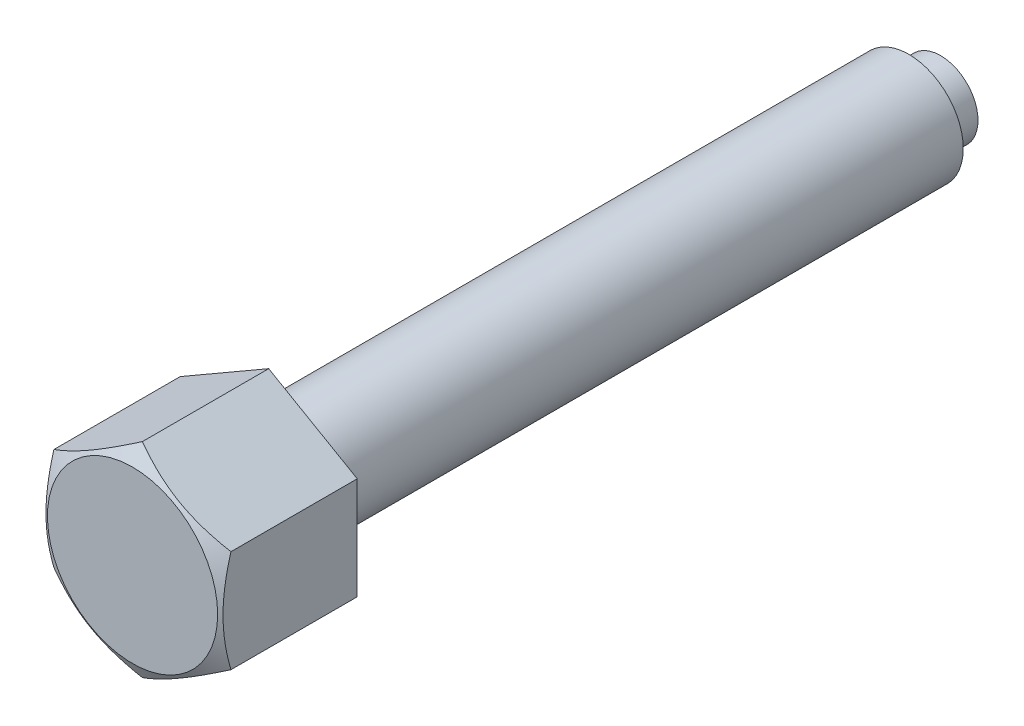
ISO-10303-21;
HEADER;
FILE_DESCRIPTION(('STEP AP214'),'2;1');
FILE_NAME('part.step','',(''),(''),'','','');
FILE_SCHEMA(('AUTOMOTIVE_DESIGN { 1 0 10303 214 1 1 1 1 }'));
ENDSEC;
DATA;
#1=APPLICATION_CONTEXT('core data for automotive mechanical design processes');
#2=APPLICATION_PROTOCOL_DEFINITION('international standard','automotive_design',2000,#1);
#3=PRODUCT_CONTEXT('',#1,'mechanical');
#4=PRODUCT('Part','Part','',(#3));
#5=PRODUCT_RELATED_PRODUCT_CATEGORY('part','',(#4));
#6=PRODUCT_DEFINITION_FORMATION('','',#4);
#7=PRODUCT_DEFINITION_CONTEXT('part definition',#1,'design');
#8=PRODUCT_DEFINITION('design','',#6,#7);
#9=PRODUCT_DEFINITION_SHAPE('','',#8);
#10=(LENGTH_UNIT() NAMED_UNIT(*) SI_UNIT(.MILLI.,.METRE.));
#11=(NAMED_UNIT(*) PLANE_ANGLE_UNIT() SI_UNIT($,.RADIAN.));
#12=(NAMED_UNIT(*) SI_UNIT($,.STERADIAN.) SOLID_ANGLE_UNIT());
#13=UNCERTAINTY_MEASURE_WITH_UNIT(LENGTH_MEASURE(1.E-05),#10,'distance_accuracy_value','');
#14=(GEOMETRIC_REPRESENTATION_CONTEXT(3) GLOBAL_UNCERTAINTY_ASSIGNED_CONTEXT((#13)) GLOBAL_UNIT_ASSIGNED_CONTEXT((#10,
#11,#12)) REPRESENTATION_CONTEXT('',''));
#15=CARTESIAN_POINT('',(0.,0.,0.));
#16=DIRECTION('',(0.,0.,1.));
#17=DIRECTION('',(1.,0.,0.));
#18=AXIS2_PLACEMENT_3D('',#15,#16,#17);
#19=CARTESIAN_POINT('',(0.,7.50555349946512,48.));
#20=DIRECTION('',(-0.5,-0.86602540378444,0.));
#21=DIRECTION('',(0.86602540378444,-0.5,0.));
#22=AXIS2_PLACEMENT_3D('',#19,#20,#21);
#23=PLANE('',#22);
#24=CARTESIAN_POINT('',(6.5002,3.75266127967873,59.2750391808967));
#25=CARTESIAN_POINT('',(6.35732254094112,3.8351516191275,59.3226580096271));
#26=CARTESIAN_POINT('',(6.21391236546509,3.91794952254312,59.3681157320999));
#27=CARTESIAN_POINT('',(5.92592736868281,4.08421773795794,59.4541137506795));
#28=CARTESIAN_POINT('',(5.78135207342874,4.16768832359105,59.4946519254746));
#29=CARTESIAN_POINT('',(5.34531134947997,4.41943655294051,59.6080914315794));
#30=CARTESIAN_POINT('',(5.05212471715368,4.58870793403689,59.6726146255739));
#31=CARTESIAN_POINT('',(4.61337625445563,4.84201947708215,59.7482758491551));
#32=CARTESIAN_POINT('',(4.46912536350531,4.92530276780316,59.7698295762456));
#33=CARTESIAN_POINT('',(4.17997178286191,5.09224566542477,59.8059721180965));
#34=CARTESIAN_POINT('',(4.03506915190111,5.17590523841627,59.8205615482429));
#35=CARTESIAN_POINT('',(3.74501222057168,5.34336968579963,59.8424036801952));
#36=CARTESIAN_POINT('',(3.59985839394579,5.42717428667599,59.8496647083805));
#37=CARTESIAN_POINT('',(3.30942466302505,5.59485627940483,59.8567021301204));
#38=CARTESIAN_POINT('',(3.16414476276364,5.6787336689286,59.8564787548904));
#39=CARTESIAN_POINT('',(2.76612405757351,5.90853103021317,59.8455789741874));
#40=CARTESIAN_POINT('',(2.51351353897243,6.05437578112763,59.8272806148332));
#41=CARTESIAN_POINT('',(2.00997032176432,6.34509659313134,59.7692560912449));
#42=CARTESIAN_POINT('',(1.75903939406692,6.48997163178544,59.7295100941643));
#43=CARTESIAN_POINT('',(1.25448277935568,6.78127752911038,59.6301565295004));
#44=CARTESIAN_POINT('',(1.00092075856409,6.92767163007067,59.5701280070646));
#45=CARTESIAN_POINT('',(0.497578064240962,7.21827667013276,59.4338874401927));
#46=CARTESIAN_POINT('',(0.247790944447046,7.36249133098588,59.357707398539));
#47=CARTESIAN_POINT('',(-0.000199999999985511,7.50566896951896,59.2750391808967));
#48=B_SPLINE_CURVE_WITH_KNOTS('',3,(#24,#25,#26,#27,#28,#29,#30,#31,#32,#33,#34,#35,#36,#37,#38,
#39,#40,#41,#42,#43,#44,#45,#46,#47),.UNSPECIFIED.,.F.,.F.,(4,2,2,2,2,2,2,2,2,2,2,4),(0.,
0.51510505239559,1.03043143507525,2.06322554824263,2.56697389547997,3.07067772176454,
3.57380860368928,4.07692394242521,4.9527935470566,5.82947446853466,6.72559912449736,
7.61996451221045),.UNSPECIFIED.);
#49=CARTESIAN_POINT('',(6.5,3.75277674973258,59.2751058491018));
#50=VERTEX_POINT('',#49);
#51=CARTESIAN_POINT('',(0.,7.50555349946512,59.2751058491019));
#52=VERTEX_POINT('',#51);
#53=EDGE_CURVE('E30',#50,#52,#48,.T.);
#54=ORIENTED_EDGE('',*,*,#53,.F.);
#55=DIRECTION('',(0.,0.,1.));
#56=VECTOR('',#55,1.);
#57=CARTESIAN_POINT('',(6.5,3.75277674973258,48.));
#58=LINE('',#57,#56);
#59=CARTESIAN_POINT('',(6.5,3.75277674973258,50.));
#60=VERTEX_POINT('',#59);
#61=EDGE_CURVE('E97',#60,#50,#58,.T.);
#62=ORIENTED_EDGE('',*,*,#61,.F.);
#63=DIRECTION('',(0.86602540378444,-0.5,0.));
#64=VECTOR('',#63,1.);
#65=CARTESIAN_POINT('',(6.25,3.89711431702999,50.));
#66=LINE('',#65,#64);
#67=CARTESIAN_POINT('',(0.,7.50555349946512,50.));
#68=VERTEX_POINT('',#67);
#69=EDGE_CURVE('E111',#68,#60,#66,.T.);
#70=ORIENTED_EDGE('',*,*,#69,.F.);
#71=DIRECTION('',(0.,0.,1.));
#72=VECTOR('',#71,1.);
#73=CARTESIAN_POINT('',(0.,7.50555349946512,48.));
#74=LINE('',#73,#72);
#75=EDGE_CURVE('E37',#68,#52,#74,.T.);
#76=ORIENTED_EDGE('',*,*,#75,.T.);
#77=EDGE_LOOP('',(#54,#62,#70,#76));
#78=FACE_BOUND('',#77,.T.);
#79=ADVANCED_FACE('F15',(#78),#23,.F.);
#80=CARTESIAN_POINT('',(6.5,3.75277674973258,48.));
#81=DIRECTION('',(-1.,0.,0.));
#82=DIRECTION('',(0.,-1.,0.));
#83=AXIS2_PLACEMENT_3D('',#80,#81,#82);
#84=PLANE('',#83);
#85=CARTESIAN_POINT('',(6.5,-10.0139298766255,56.715718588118));
#86=CARTESIAN_POINT('',(6.5,-9.73058065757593,56.8528996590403));
#87=CARTESIAN_POINT('',(6.5,-9.44657378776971,56.9887459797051));
#88=CARTESIAN_POINT('',(6.5,-8.87689475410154,57.2570170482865));
#89=CARTESIAN_POINT('',(6.5,-8.59122233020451,57.3894412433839));
#90=CARTESIAN_POINT('',(6.5,-8.01635817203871,57.6507965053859));
#91=CARTESIAN_POINT('',(6.5,-7.72715570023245,57.7797040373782));
#92=CARTESIAN_POINT('',(6.5,-7.14642707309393,58.032154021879));
#93=CARTESIAN_POINT('',(6.5,-6.85490103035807,58.1556967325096));
#94=CARTESIAN_POINT('',(6.5,-6.25991674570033,58.3997495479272));
#95=CARTESIAN_POINT('',(6.5,-5.95636992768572,58.5200449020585));
#96=CARTESIAN_POINT('',(6.5,-5.34570022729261,58.7513690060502));
#97=CARTESIAN_POINT('',(6.5,-5.03857694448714,58.8623967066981));
#98=CARTESIAN_POINT('',(6.5,-4.42086358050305,59.0722223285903));
#99=CARTESIAN_POINT('',(6.5,-4.11028219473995,59.1710455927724));
#100=CARTESIAN_POINT('',(6.5,-3.48466200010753,59.3532463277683));
#101=CARTESIAN_POINT('',(6.5,-3.16962465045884,59.436628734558));
#102=CARTESIAN_POINT('',(6.5,-2.53666221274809,59.5834676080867));
#103=CARTESIAN_POINT('',(6.5,-2.21876196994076,59.6470294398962));
#104=CARTESIAN_POINT('',(6.5,-1.57903427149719,59.7505723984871));
#105=CARTESIAN_POINT('',(6.5,-1.25720716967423,59.7905556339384));
#106=CARTESIAN_POINT('',(6.5,-0.774936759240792,59.8301899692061));
#107=CARTESIAN_POINT('',(6.5,-0.61528846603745,59.8400119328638));
#108=CARTESIAN_POINT('',(6.5,-0.29571263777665,59.85290641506));
#109=CARTESIAN_POINT('',(6.5,-0.135785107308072,59.855979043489));
#110=CARTESIAN_POINT('',(6.5,0.18405523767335,59.8552940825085));
#111=CARTESIAN_POINT('',(6.5,0.343968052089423,59.8515364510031));
#112=CARTESIAN_POINT('',(6.5,0.663495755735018,59.8372836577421));
#113=CARTESIAN_POINT('',(6.5,0.823110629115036,59.8267881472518));
#114=CARTESIAN_POINT('',(6.5,1.20875169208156,59.7935096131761));
#115=CARTESIAN_POINT('',(6.5,1.43449799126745,59.7674163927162));
#116=CARTESIAN_POINT('',(6.5,1.88426052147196,59.7031906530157));
#117=CARTESIAN_POINT('',(6.5,2.10827650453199,59.6650564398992));
#118=CARTESIAN_POINT('',(6.5,2.77750341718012,59.5346190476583));
#119=CARTESIAN_POINT('',(6.5,3.21963223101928,59.4263065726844));
#120=CARTESIAN_POINT('',(6.5,3.88064905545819,59.239172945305));
#121=CARTESIAN_POINT('',(6.5,4.10298279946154,59.1718291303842));
#122=CARTESIAN_POINT('',(6.5,4.54548971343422,59.0303191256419));
#123=CARTESIAN_POINT('',(6.5,4.76566286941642,58.9561528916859));
#124=CARTESIAN_POINT('',(6.5,5.20392125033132,58.8021736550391));
#125=CARTESIAN_POINT('',(6.5,5.4220071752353,58.7223626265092));
#126=CARTESIAN_POINT('',(6.5,5.85638376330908,58.5580156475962));
#127=CARTESIAN_POINT('',(6.5,6.07267444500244,58.4734797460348));
#128=CARTESIAN_POINT('',(6.5,6.57261566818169,58.2727908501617));
#129=CARTESIAN_POINT('',(6.5,6.8556779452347,58.1551753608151));
#130=CARTESIAN_POINT('',(6.5,7.4194854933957,57.9145016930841));
#131=CARTESIAN_POINT('',(6.5,7.70023063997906,57.7914432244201));
#132=CARTESIAN_POINT('',(6.5,8.25981709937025,57.540947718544));
#133=CARTESIAN_POINT('',(6.5,8.53865805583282,57.4135098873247));
#134=CARTESIAN_POINT('',(6.5,9.09470419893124,57.1551081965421));
#135=CARTESIAN_POINT('',(6.5,9.37190935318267,57.0241442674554));
#136=CARTESIAN_POINT('',(6.5,9.92519356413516,56.759216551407));
#137=CARTESIAN_POINT('',(6.5,10.2012713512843,56.6252501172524));
#138=CARTESIAN_POINT('',(6.5,10.7522585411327,56.3549336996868));
#139=CARTESIAN_POINT('',(6.5,11.027167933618,56.2185836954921));
#140=CARTESIAN_POINT('',(6.5,11.8504287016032,55.8065716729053));
#141=CARTESIAN_POINT('',(6.5,12.3973011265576,55.5279532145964));
#142=CARTESIAN_POINT('',(6.5,13.1934294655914,55.1171865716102));
#143=CARTESIAN_POINT('',(6.5,13.4438297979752,54.9872425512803));
#144=CARTESIAN_POINT('',(6.5,13.9440869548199,54.7263219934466));
#145=CARTESIAN_POINT('',(6.5,14.19394378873,54.5953454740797));
#146=CARTESIAN_POINT('',(6.5,14.9428276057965,54.201065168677));
#147=CARTESIAN_POINT('',(6.5,15.4411486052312,53.9364206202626));
#148=CARTESIAN_POINT('',(6.5,16.4351698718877,53.4050149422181));
#149=CARTESIAN_POINT('',(6.5,16.9308735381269,53.1382601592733));
#150=CARTESIAN_POINT('',(6.5,17.9210819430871,52.602594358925));
#151=CARTESIAN_POINT('',(6.5,18.4155867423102,52.3336834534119));
#152=CARTESIAN_POINT('',(6.5,18.9096470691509,52.0639635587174));
#153=B_SPLINE_CURVE_WITH_KNOTS('',3,(#85,#86,#87,#88,#89,#90,#91,#92,#93,#94,#95,#96,#97,#98,
#99,#100,#101,#102,#103,#104,#105,#106,#107,#108,#109,#110,#111,#112,#113,#114,#115,#116,#117,
#118,#119,#120,#121,#122,#123,#124,#125,#126,#127,#128,#129,#130,#131,#132,#133,#134,#135,#136,
#137,#138,#139,#140,#141,#142,#143,#144,#145,#146,#147,#148,#149,#150,#151,#152),.UNSPECIFIED.,
.F.,.F.,(4,2,2,2,2,2,2,2,2,2,2,2,2,2,2,2,2,2,2,2,2,2,2,2,2,2,2,2,2,2,2,2,2,4),(0.,
0.944442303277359,1.88903623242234,2.83888579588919,3.78868960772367,4.7681159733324,
5.74765307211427,6.72512064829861,7.70227521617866,8.67414306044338,9.64592397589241,
10.1256534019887,10.6053750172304,11.0850995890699,11.5648489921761,12.2462106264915,
12.927668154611,14.291366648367,14.9882378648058,15.6851135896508,16.3817467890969,
17.0783727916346,17.9978725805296,18.9174214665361,19.8371379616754,20.7568726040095,
21.6774527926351,22.5980410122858,24.4392558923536,25.2855836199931,26.1318965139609,
27.8245874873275,29.5133454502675,31.2020163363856),.UNSPECIFIED.);
#154=CARTESIAN_POINT('',(6.5,-3.75277674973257,59.2751058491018));
#155=VERTEX_POINT('',#154);
#156=EDGE_CURVE('E157',#155,#50,#153,.T.);
#157=ORIENTED_EDGE('',*,*,#156,.F.);
#158=DIRECTION('',(0.,0.,1.));
#159=VECTOR('',#158,1.);
#160=CARTESIAN_POINT('',(6.5,-3.75277674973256,48.));
#161=LINE('',#160,#159);
#162=CARTESIAN_POINT('',(6.5,-3.75277674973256,50.));
#163=VERTEX_POINT('',#162);
#164=EDGE_CURVE('E94',#163,#155,#161,.T.);
#165=ORIENTED_EDGE('',*,*,#164,.F.);
#166=DIRECTION('',(0.,-1.,0.));
#167=VECTOR('',#166,1.);
#168=CARTESIAN_POINT('',(6.5,0.,50.));
#169=LINE('',#168,#167);
#170=EDGE_CURVE('E108',#60,#163,#169,.T.);
#171=ORIENTED_EDGE('',*,*,#170,.F.);
#172=ORIENTED_EDGE('',*,*,#61,.T.);
#173=EDGE_LOOP('',(#157,#165,#171,#172));
#174=FACE_BOUND('',#173,.T.);
#175=ADVANCED_FACE('F137',(#174),#84,.F.);
#176=CARTESIAN_POINT('',(0.,-7.50555349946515,48.));
#177=DIRECTION('',(0.5,-0.866025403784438,0.));
#178=DIRECTION('',(0.866025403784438,0.5,0.));
#179=AXIS2_PLACEMENT_3D('',#176,#177,#178);
#180=PLANE('',#179);
#181=ORIENTED_EDGE('',*,*,#164,.T.);
#182=CARTESIAN_POINT('',(6.5002,-3.75266127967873,59.2750391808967));
#183=CARTESIAN_POINT('',(6.35732254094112,-3.83515161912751,59.3226580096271));
#184=CARTESIAN_POINT('',(6.21391236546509,-3.91794952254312,59.3681157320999));
#185=CARTESIAN_POINT('',(5.92592736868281,-4.08421773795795,59.4541137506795));
#186=CARTESIAN_POINT('',(5.78135207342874,-4.16768832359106,59.4946519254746));
#187=CARTESIAN_POINT('',(5.34531134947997,-4.41943655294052,59.6080914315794));
#188=CARTESIAN_POINT('',(5.05212471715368,-4.5887079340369,59.6726146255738));
#189=CARTESIAN_POINT('',(4.61337625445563,-4.84201947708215,59.7482758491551));
#190=CARTESIAN_POINT('',(4.46912536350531,-4.92530276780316,59.7698295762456));
#191=CARTESIAN_POINT('',(4.17997178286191,-5.09224566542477,59.8059721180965));
#192=CARTESIAN_POINT('',(4.03506915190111,-5.17590523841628,59.8205615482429));
#193=CARTESIAN_POINT('',(3.74501222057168,-5.34336968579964,59.8424036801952));
#194=CARTESIAN_POINT('',(3.59985839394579,-5.427174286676,59.8496647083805));
#195=CARTESIAN_POINT('',(3.30942466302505,-5.59485627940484,59.8567021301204));
#196=CARTESIAN_POINT('',(3.16414476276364,-5.67873366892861,59.8564787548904));
#197=CARTESIAN_POINT('',(2.76612405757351,-5.90853103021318,59.8455789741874));
#198=CARTESIAN_POINT('',(2.51351353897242,-6.05437578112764,59.8272806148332));
#199=CARTESIAN_POINT('',(2.00997032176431,-6.34509659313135,59.7692560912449));
#200=CARTESIAN_POINT('',(1.75903939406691,-6.48997163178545,59.7295100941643));
#201=CARTESIAN_POINT('',(1.25448277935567,-6.7812775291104,59.6301565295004));
#202=CARTESIAN_POINT('',(1.00092075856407,-6.92767163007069,59.5701280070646));
#203=CARTESIAN_POINT('',(0.497578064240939,-7.21827667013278,59.4338874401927));
#204=CARTESIAN_POINT('',(0.24779094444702,-7.3624913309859,59.357707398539));
#205=CARTESIAN_POINT('',(-0.000200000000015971,-7.50566896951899,59.2750391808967));
#206=B_SPLINE_CURVE_WITH_KNOTS('',3,(#182,#183,#184,#185,#186,#187,#188,#189,#190,#191,#192,
#193,#194,#195,#196,#197,#198,#199,#200,#201,#202,#203,#204,#205),.UNSPECIFIED.,.F.,.F.,(4,2,2,
2,2,2,2,2,2,2,2,4),(0.,0.515105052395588,1.03043143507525,2.06322554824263,2.56697389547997,
3.07067772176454,3.57380860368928,4.07692394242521,4.95279354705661,5.82947446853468,
6.72559912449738,7.61996451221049),.UNSPECIFIED.);
#207=CARTESIAN_POINT('',(0.,-7.50555349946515,59.2751058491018));
#208=VERTEX_POINT('',#207);
#209=EDGE_CURVE('E163',#155,#208,#206,.T.);
#210=ORIENTED_EDGE('',*,*,#209,.T.);
#211=DIRECTION('',(0.,0.,1.));
#212=VECTOR('',#211,1.);
#213=CARTESIAN_POINT('',(0.,-7.50555349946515,48.));
#214=LINE('',#213,#212);
#215=CARTESIAN_POINT('',(0.,-7.50555349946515,50.));
#216=VERTEX_POINT('',#215);
#217=EDGE_CURVE('E87',#216,#208,#214,.T.);
#218=ORIENTED_EDGE('',*,*,#217,.F.);
#219=DIRECTION('',(0.866025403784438,0.5,0.));
#220=VECTOR('',#219,1.);
#221=CARTESIAN_POINT('',(6.25,-3.89711431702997,50.));
#222=LINE('',#221,#220);
#223=EDGE_CURVE('E106',#216,#163,#222,.T.);
#224=ORIENTED_EDGE('',*,*,#223,.T.);
#225=EDGE_LOOP('',(#181,#210,#218,#224));
#226=FACE_BOUND('',#225,.T.);
#227=ADVANCED_FACE('F143',(#226),#180,.T.);
#228=CARTESIAN_POINT('',(0.,-7.50555349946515,48.));
#229=DIRECTION('',(0.5,0.866025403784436,0.));
#230=DIRECTION('',(-0.866025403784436,0.5,0.));
#231=AXIS2_PLACEMENT_3D('',#228,#229,#230);
#232=PLANE('',#231);
#233=CARTESIAN_POINT('',(-6.5002,-3.75266127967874,59.2750391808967));
#234=CARTESIAN_POINT('',(-6.35732254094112,-3.83515161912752,59.3226580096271));
#235=CARTESIAN_POINT('',(-6.21391236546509,-3.91794952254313,59.3681157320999));
#236=CARTESIAN_POINT('',(-5.92592736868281,-4.08421773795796,59.4541137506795));
#237=CARTESIAN_POINT('',(-5.78135207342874,-4.16768832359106,59.4946519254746));
#238=CARTESIAN_POINT('',(-5.34531134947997,-4.41943655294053,59.6080914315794));
#239=CARTESIAN_POINT('',(-5.05212471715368,-4.58870793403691,59.6726146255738));
#240=CARTESIAN_POINT('',(-4.61337625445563,-4.84201947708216,59.7482758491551));
#241=CARTESIAN_POINT('',(-4.46912536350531,-4.92530276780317,59.7698295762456));
#242=CARTESIAN_POINT('',(-4.17997178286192,-5.09224566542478,59.8059721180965));
#243=CARTESIAN_POINT('',(-4.03506915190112,-5.17590523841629,59.8205615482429));
#244=CARTESIAN_POINT('',(-3.74501222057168,-5.34336968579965,59.8424036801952));
#245=CARTESIAN_POINT('',(-3.59985839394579,-5.42717428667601,59.8496647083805));
#246=CARTESIAN_POINT('',(-3.30942466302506,-5.59485627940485,59.8567021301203));
#247=CARTESIAN_POINT('',(-3.16414476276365,-5.67873366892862,59.8564787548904));
#248=CARTESIAN_POINT('',(-2.76612405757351,-5.90853103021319,59.8455789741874));
#249=CARTESIAN_POINT('',(-2.51351353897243,-6.05437578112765,59.8272806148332));
#250=CARTESIAN_POINT('',(-2.00997032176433,-6.34509659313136,59.7692560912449));
#251=CARTESIAN_POINT('',(-1.75903939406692,-6.48997163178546,59.7295100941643));
#252=CARTESIAN_POINT('',(-1.25448277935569,-6.7812775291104,59.6301565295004));
#253=CARTESIAN_POINT('',(-1.00092075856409,-6.92767163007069,59.5701280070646));
#254=CARTESIAN_POINT('',(-0.497578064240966,-7.21827667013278,59.4338874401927));
#255=CARTESIAN_POINT('',(-0.247790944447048,-7.3624913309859,59.357707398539));
#256=CARTESIAN_POINT('',(0.000199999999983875,-7.50566896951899,59.2750391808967));
#257=B_SPLINE_CURVE_WITH_KNOTS('',3,(#233,#234,#235,#236,#237,#238,#239,#240,#241,#242,#243,
#244,#245,#246,#247,#248,#249,#250,#251,#252,#253,#254,#255,#256),.UNSPECIFIED.,.F.,.F.,(4,2,2,
2,2,2,2,2,2,2,2,4),(0.,0.515105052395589,1.03043143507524,2.06322554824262,2.56697389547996,
3.07067772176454,3.57380860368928,4.0769239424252,4.9527935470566,5.82947446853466,
6.72559912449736,7.61996451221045),.UNSPECIFIED.);
#258=CARTESIAN_POINT('',(-6.5,-3.75277674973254,59.2751058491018));
#259=VERTEX_POINT('',#258);
#260=EDGE_CURVE('E81',#259,#208,#257,.T.);
#261=ORIENTED_EDGE('',*,*,#260,.F.);
#262=DIRECTION('',(0.,0.,1.));
#263=VECTOR('',#262,1.);
#264=CARTESIAN_POINT('',(-6.5,-3.75277674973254,48.));
#265=LINE('',#264,#263);
#266=CARTESIAN_POINT('',(-6.5,-3.75277674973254,50.));
#267=VERTEX_POINT('',#266);
#268=EDGE_CURVE('E80',#267,#259,#265,.T.);
#269=ORIENTED_EDGE('',*,*,#268,.F.);
#270=DIRECTION('',(-0.866025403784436,0.5,0.));
#271=VECTOR('',#270,1.);
#272=CARTESIAN_POINT('',(-0.250000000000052,-7.36121593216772,50.));
#273=LINE('',#272,#271);
#274=EDGE_CURVE('E103',#216,#267,#273,.T.);
#275=ORIENTED_EDGE('',*,*,#274,.F.);
#276=ORIENTED_EDGE('',*,*,#217,.T.);
#277=EDGE_LOOP('',(#261,#269,#275,#276));
#278=FACE_BOUND('',#277,.T.);
#279=ADVANCED_FACE('F239',(#278),#232,.F.);
#280=CARTESIAN_POINT('',(-6.5,3.75277674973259,48.));
#281=DIRECTION('',(-1.,0.,0.));
#282=DIRECTION('',(0.,-1.,0.));
#283=AXIS2_PLACEMENT_3D('',#280,#281,#282);
#284=PLANE('',#283);
#285=ORIENTED_EDGE('',*,*,#268,.T.);
#286=CARTESIAN_POINT('',(-6.5,-10.0139298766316,56.7157185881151));
#287=CARTESIAN_POINT('',(-6.5,-9.7305806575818,56.8528996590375));
#288=CARTESIAN_POINT('',(-6.5,-9.44657378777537,56.9887459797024));
#289=CARTESIAN_POINT('',(-6.5,-8.87689475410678,57.257017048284));
#290=CARTESIAN_POINT('',(-6.5,-8.59122233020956,57.3894412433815));
#291=CARTESIAN_POINT('',(-6.5,-8.01635817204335,57.6507965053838));
#292=CARTESIAN_POINT('',(-6.5,-7.72715570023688,57.7797040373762));
#293=CARTESIAN_POINT('',(-6.5,-7.14642707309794,58.0321540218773));
#294=CARTESIAN_POINT('',(-6.5,-6.85490103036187,58.155696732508));
#295=CARTESIAN_POINT('',(-6.5,-6.2599167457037,58.3997495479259));
#296=CARTESIAN_POINT('',(-6.5,-5.95636992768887,58.5200449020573));
#297=CARTESIAN_POINT('',(-6.5,-5.34570022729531,58.7513690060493));
#298=CARTESIAN_POINT('',(-6.5,-5.0385769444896,58.8623967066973));
#299=CARTESIAN_POINT('',(-6.5,-4.42086358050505,59.0722223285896));
#300=CARTESIAN_POINT('',(-6.5,-4.11028219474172,59.1710455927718));
#301=CARTESIAN_POINT('',(-6.5,-3.48466200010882,59.353246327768));
#302=CARTESIAN_POINT('',(-6.5,-3.16962465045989,59.4366287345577));
#303=CARTESIAN_POINT('',(-6.5,-2.53666221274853,59.5834676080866));
#304=CARTESIAN_POINT('',(-6.5,-2.21876196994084,59.6470294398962));
#305=CARTESIAN_POINT('',(-6.5,-1.57903427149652,59.7505723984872));
#306=CARTESIAN_POINT('',(-6.5,-1.25720716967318,59.7905556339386));
#307=CARTESIAN_POINT('',(-6.5,-0.774936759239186,59.8301899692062));
#308=CARTESIAN_POINT('',(-6.5,-0.615288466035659,59.8400119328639));
#309=CARTESIAN_POINT('',(-6.5,-0.295712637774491,59.8529064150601));
#310=CARTESIAN_POINT('',(-6.5,-0.13578510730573,59.855979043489));
#311=CARTESIAN_POINT('',(-6.5,0.184055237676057,59.8552940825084));
#312=CARTESIAN_POINT('',(-6.5,0.343968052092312,59.851536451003));
#313=CARTESIAN_POINT('',(-6.5,0.66349575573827,59.8372836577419));
#314=CARTESIAN_POINT('',(-6.5,0.823110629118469,59.8267881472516));
#315=CARTESIAN_POINT('',(-6.5,1.20875169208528,59.7935096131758));
#316=CARTESIAN_POINT('',(-6.5,1.43449799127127,59.7674163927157));
#317=CARTESIAN_POINT('',(-6.5,1.88426052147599,59.703190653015));
#318=CARTESIAN_POINT('',(-6.5,2.10827650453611,59.6650564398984));
#319=CARTESIAN_POINT('',(-6.5,2.77750341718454,59.5346190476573));
#320=CARTESIAN_POINT('',(-6.5,3.21963223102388,59.4263065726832));
#321=CARTESIAN_POINT('',(-6.5,3.88064905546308,59.2391729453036));
#322=CARTESIAN_POINT('',(-6.5,4.10298279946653,59.1718291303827));
#323=CARTESIAN_POINT('',(-6.5,4.5454897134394,59.0303191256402));
#324=CARTESIAN_POINT('',(-6.5,4.76566286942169,58.9561528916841));
#325=CARTESIAN_POINT('',(-6.5,5.20392125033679,58.8021736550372));
#326=CARTESIAN_POINT('',(-6.5,5.42200717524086,58.7223626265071));
#327=CARTESIAN_POINT('',(-6.5,5.85638376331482,58.558015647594));
#328=CARTESIAN_POINT('',(-6.5,6.07267444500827,58.4734797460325));
#329=CARTESIAN_POINT('',(-6.5,6.57261566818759,58.2727908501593));
#330=CARTESIAN_POINT('',(-6.5,6.85567794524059,58.1551753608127));
#331=CARTESIAN_POINT('',(-6.5,7.41948549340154,57.9145016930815));
#332=CARTESIAN_POINT('',(-6.5,7.70023063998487,57.7914432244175));
#333=CARTESIAN_POINT('',(-6.5,8.25981709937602,57.5409477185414));
#334=CARTESIAN_POINT('',(-6.5,8.53865805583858,57.413509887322));
#335=CARTESIAN_POINT('',(-6.5,9.09470419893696,57.1551081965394));
#336=CARTESIAN_POINT('',(-6.5,9.37190935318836,57.0241442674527));
#337=CARTESIAN_POINT('',(-6.5,9.92519356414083,56.7592165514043));
#338=CARTESIAN_POINT('',(-6.5,10.20127135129,56.6252501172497));
#339=CARTESIAN_POINT('',(-6.5,10.7522585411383,56.354933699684));
#340=CARTESIAN_POINT('',(-6.5,11.0271679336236,56.2185836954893));
#341=CARTESIAN_POINT('',(-6.5,11.8504287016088,55.8065716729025));
#342=CARTESIAN_POINT('',(-6.5,12.3973011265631,55.5279532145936));
#343=CARTESIAN_POINT('',(-6.5,13.1934294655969,55.1171865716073));
#344=CARTESIAN_POINT('',(-6.5,13.4438297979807,54.9872425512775));
#345=CARTESIAN_POINT('',(-6.5,13.9440869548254,54.7263219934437));
#346=CARTESIAN_POINT('',(-6.5,14.1939437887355,54.5953454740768));
#347=CARTESIAN_POINT('',(-6.5,14.942827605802,54.2010651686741));
#348=CARTESIAN_POINT('',(-6.5,15.4411486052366,53.9364206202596));
#349=CARTESIAN_POINT('',(-6.5,16.4351698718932,53.4050149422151));
#350=CARTESIAN_POINT('',(-6.5,16.9308735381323,53.1382601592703));
#351=CARTESIAN_POINT('',(-6.5,17.9210819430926,52.602594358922));
#352=CARTESIAN_POINT('',(-6.5,18.4155867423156,52.3336834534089));
#353=CARTESIAN_POINT('',(-6.5,18.9096470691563,52.0639635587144));
#354=B_SPLINE_CURVE_WITH_KNOTS('',3,(#286,#287,#288,#289,#290,#291,#292,#293,#294,#295,#296,
#297,#298,#299,#300,#301,#302,#303,#304,#305,#306,#307,#308,#309,#310,#311,#312,#313,#314,#315,
#316,#317,#318,#319,#320,#321,#322,#323,#324,#325,#326,#327,#328,#329,#330,#331,#332,#333,#334,
#335,#336,#337,#338,#339,#340,#341,#342,#343,#344,#345,#346,#347,#348,#349,#350,#351,#352,#353),
.UNSPECIFIED.,.F.,.F.,(4,2,2,2,2,2,2,2,2,2,2,2,2,2,2,2,2,2,2,2,2,2,2,2,2,2,2,2,2,2,2,2,2,4),(0.,
0.944442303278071,1.88903623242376,2.83888579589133,3.78868960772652,4.76811597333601,
5.74765307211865,6.72512064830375,7.70227521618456,8.67414306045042,9.64592397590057,
10.1256534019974,10.6053750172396,11.0850995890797,11.5648489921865,12.2462106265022,
12.927668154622,14.2913666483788,14.9882378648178,15.6851135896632,16.3817467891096,
17.0783727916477,17.9978725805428,18.9174214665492,19.8371379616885,20.7568726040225,
21.6774527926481,22.5980410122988,24.4392558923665,25.2855836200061,26.1318965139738,
27.8245874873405,29.5133454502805,31.2020163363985),.UNSPECIFIED.);
#355=CARTESIAN_POINT('',(-6.5,3.75277674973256,59.2751058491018));
#356=VERTEX_POINT('',#355);
#357=EDGE_CURVE('E68',#259,#356,#354,.T.);
#358=ORIENTED_EDGE('',*,*,#357,.T.);
#359=DIRECTION('',(0.,0.,1.));
#360=VECTOR('',#359,1.);
#361=CARTESIAN_POINT('',(-6.5,3.75277674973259,48.));
#362=LINE('',#361,#360);
#363=CARTESIAN_POINT('',(-6.5,3.75277674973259,50.));
#364=VERTEX_POINT('',#363);
#365=EDGE_CURVE('E77',#364,#356,#362,.T.);
#366=ORIENTED_EDGE('',*,*,#365,.F.);
#367=DIRECTION('',(0.,-1.,0.));
#368=VECTOR('',#367,1.);
#369=CARTESIAN_POINT('',(-6.5,0.,50.));
#370=LINE('',#369,#368);
#371=EDGE_CURVE('E101',#364,#267,#370,.T.);
#372=ORIENTED_EDGE('',*,*,#371,.T.);
#373=EDGE_LOOP('',(#285,#358,#366,#372));
#374=FACE_BOUND('',#373,.T.);
#375=ADVANCED_FACE('F76',(#374),#284,.T.);
#376=CARTESIAN_POINT('',(0.,7.50555349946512,48.));
#377=DIRECTION('',(-0.5,0.866025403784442,0.));
#378=DIRECTION('',(-0.866025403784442,-0.5,0.));
#379=AXIS2_PLACEMENT_3D('',#376,#377,#378);
#380=PLANE('',#379);
#381=ORIENTED_EDGE('',*,*,#365,.T.);
#382=CARTESIAN_POINT('',(-6.5002,3.75266127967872,59.2750391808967));
#383=CARTESIAN_POINT('',(-6.35732254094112,3.83515161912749,59.3226580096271));
#384=CARTESIAN_POINT('',(-6.21391236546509,3.91794952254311,59.3681157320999));
#385=CARTESIAN_POINT('',(-5.92592736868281,4.08421773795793,59.4541137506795));
#386=CARTESIAN_POINT('',(-5.78135207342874,4.16768832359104,59.4946519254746));
#387=CARTESIAN_POINT('',(-5.34531134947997,4.4194365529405,59.6080914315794));
#388=CARTESIAN_POINT('',(-5.05212471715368,4.58870793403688,59.6726146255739));
#389=CARTESIAN_POINT('',(-4.61337625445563,4.84201947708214,59.7482758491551));
#390=CARTESIAN_POINT('',(-4.46912536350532,4.92530276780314,59.7698295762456));
#391=CARTESIAN_POINT('',(-4.17997178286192,5.09224566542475,59.8059721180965));
#392=CARTESIAN_POINT('',(-4.03506915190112,5.17590523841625,59.8205615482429));
#393=CARTESIAN_POINT('',(-3.74501222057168,5.34336968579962,59.8424036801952));
#394=CARTESIAN_POINT('',(-3.59985839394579,5.42717428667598,59.8496647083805));
#395=CARTESIAN_POINT('',(-3.30942466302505,5.59485627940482,59.8567021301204));
#396=CARTESIAN_POINT('',(-3.16414476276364,5.67873366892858,59.8564787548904));
#397=CARTESIAN_POINT('',(-2.7661240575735,5.90853103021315,59.8455789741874));
#398=CARTESIAN_POINT('',(-2.51351353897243,6.05437578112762,59.8272806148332));
#399=CARTESIAN_POINT('',(-2.00997032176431,6.34509659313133,59.7692560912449));
#400=CARTESIAN_POINT('',(-1.75903939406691,6.48997163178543,59.7295100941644));
#401=CARTESIAN_POINT('',(-1.25448277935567,6.78127752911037,59.6301565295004));
#402=CARTESIAN_POINT('',(-1.00092075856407,6.92767163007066,59.5701280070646));
#403=CARTESIAN_POINT('',(-0.49757806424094,7.21827667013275,59.4338874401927));
#404=CARTESIAN_POINT('',(-0.24779094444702,7.36249133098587,59.357707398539));
#405=CARTESIAN_POINT('',(0.00020000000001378,7.50566896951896,59.2750391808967));
#406=B_SPLINE_CURVE_WITH_KNOTS('',3,(#382,#383,#384,#385,#386,#387,#388,#389,#390,#391,#392,
#393,#394,#395,#396,#397,#398,#399,#400,#401,#402,#403,#404,#405),.UNSPECIFIED.,.F.,.F.,(4,2,2,
2,2,2,2,2,2,2,2,4),(0.,0.515105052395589,1.03043143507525,2.06322554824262,2.56697389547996,
3.07067772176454,3.57380860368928,4.0769239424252,4.95279354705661,5.82947446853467,
6.72559912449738,7.61996451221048),.UNSPECIFIED.);
#407=EDGE_CURVE('E65',#356,#52,#406,.T.);
#408=ORIENTED_EDGE('',*,*,#407,.T.);
#409=ORIENTED_EDGE('',*,*,#75,.F.);
#410=DIRECTION('',(-0.866025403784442,-0.5,0.));
#411=VECTOR('',#410,1.);
#412=CARTESIAN_POINT('',(-0.24999999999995,7.36121593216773,50.));
#413=LINE('',#412,#411);
#414=EDGE_CURVE('E85',#68,#364,#413,.T.);
#415=ORIENTED_EDGE('',*,*,#414,.T.);
#416=EDGE_LOOP('',(#381,#408,#409,#415));
#417=FACE_BOUND('',#416,.T.);
#418=ADVANCED_FACE('F83',(#417),#380,.T.);
#419=CARTESIAN_POINT('',(0.,0.,6.));
#420=DIRECTION('',(0.,0.,1.));
#421=DIRECTION('',(1.,0.,0.));
#422=AXIS2_PLACEMENT_3D('',#419,#420,#421);
#423=SPHERICAL_SURFACE('',#422,6.);
#424=CARTESIAN_POINT('',(0.,0.,0.667317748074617));
#425=DIRECTION('',(0.,0.,1.));
#426=DIRECTION('',(1.,0.,0.));
#427=AXIS2_PLACEMENT_3D('',#424,#425,#426);
#428=CIRCLE('',#427,2.75);
#429=CARTESIAN_POINT('',(2.75,0.,0.667317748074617));
#430=VERTEX_POINT('',#429);
#431=EDGE_CURVE('E9',#430,#430,#428,.T.);
#432=ORIENTED_EDGE('',*,*,#431,.F.);
#433=EDGE_LOOP('',(#432));
#434=FACE_BOUND('',#433,.T.);
#435=ADVANCED_FACE('F17',(#434),#423,.T.);
#436=CARTESIAN_POINT('',(0.,0.,110.));
#437=DIRECTION('',(0.,0.,1.));
#438=DIRECTION('',(1.,0.,0.));
#439=AXIS2_PLACEMENT_3D('',#436,#437,#438);
#440=CYLINDRICAL_SURFACE('',#439,2.75);
#441=ORIENTED_EDGE('',*,*,#431,.T.);
#442=EDGE_LOOP('',(#441));
#443=FACE_BOUND('',#442,.T.);
#444=CARTESIAN_POINT('',(0.,0.,3.));
#445=DIRECTION('',(0.,0.,1.));
#446=DIRECTION('',(1.,0.,0.));
#447=AXIS2_PLACEMENT_3D('',#444,#445,#446);
#448=CIRCLE('',#447,2.75);
#449=CARTESIAN_POINT('',(2.75,0.,3.));
#450=VERTEX_POINT('',#449);
#451=EDGE_CURVE('E23',#450,#450,#448,.T.);
#452=ORIENTED_EDGE('',*,*,#451,.F.);
#453=EDGE_LOOP('',(#452));
#454=FACE_BOUND('',#453,.T.);
#455=ADVANCED_FACE('F124',(#443,#454),#440,.T.);
#456=CARTESIAN_POINT('',(2.75,0.,3.));
#457=DIRECTION('',(0.,0.,1.));
#458=DIRECTION('',(1.,0.,0.));
#459=AXIS2_PLACEMENT_3D('',#456,#457,#458);
#460=PLANE('',#459);
#461=CARTESIAN_POINT('',(0.,0.,3.));
#462=DIRECTION('',(0.,0.,1.));
#463=DIRECTION('',(1.,0.,0.));
#464=AXIS2_PLACEMENT_3D('',#461,#462,#463);
#465=CIRCLE('',#464,4.);
#466=CARTESIAN_POINT('',(4.,0.,3.));
#467=VERTEX_POINT('',#466);
#468=EDGE_CURVE('E117',#467,#467,#465,.T.);
#469=ORIENTED_EDGE('',*,*,#468,.F.);
#470=EDGE_LOOP('',(#469));
#471=FACE_BOUND('',#470,.T.);
#472=ORIENTED_EDGE('',*,*,#451,.T.);
#473=EDGE_LOOP('',(#472));
#474=FACE_BOUND('',#473,.T.);
#475=ADVANCED_FACE('F122',(#471,#474),#460,.F.);
#476=CARTESIAN_POINT('',(0.,0.,110.));
#477=DIRECTION('',(0.,0.,1.));
#478=DIRECTION('',(1.,0.,0.));
#479=AXIS2_PLACEMENT_3D('',#476,#477,#478);
#480=CYLINDRICAL_SURFACE('',#479,4.);
#481=CARTESIAN_POINT('',(0.,0.,50.));
#482=DIRECTION('',(0.,0.,1.));
#483=DIRECTION('',(1.,0.,0.));
#484=AXIS2_PLACEMENT_3D('',#481,#482,#483);
#485=CIRCLE('',#484,4.);
#486=CARTESIAN_POINT('',(4.,0.,50.));
#487=VERTEX_POINT('',#486);
#488=EDGE_CURVE('E114',#487,#487,#485,.T.);
#489=ORIENTED_EDGE('',*,*,#488,.F.);
#490=EDGE_LOOP('',(#489));
#491=FACE_BOUND('',#490,.T.);
#492=ORIENTED_EDGE('',*,*,#468,.T.);
#493=EDGE_LOOP('',(#492));
#494=FACE_BOUND('',#493,.T.);
#495=ADVANCED_FACE('F132',(#491,#494),#480,.T.);
#496=CARTESIAN_POINT('',(4.,0.,50.));
#497=DIRECTION('',(0.,0.,1.));
#498=DIRECTION('',(1.,0.,0.));
#499=AXIS2_PLACEMENT_3D('',#496,#497,#498);
#500=PLANE('',#499);
#501=ORIENTED_EDGE('',*,*,#414,.F.);
#502=ORIENTED_EDGE('',*,*,#69,.T.);
#503=ORIENTED_EDGE('',*,*,#170,.T.);
#504=ORIENTED_EDGE('',*,*,#223,.F.);
#505=ORIENTED_EDGE('',*,*,#274,.T.);
#506=ORIENTED_EDGE('',*,*,#371,.F.);
#507=EDGE_LOOP('',(#501,#502,#503,#504,#505,#506));
#508=FACE_BOUND('',#507,.T.);
#509=ORIENTED_EDGE('',*,*,#488,.T.);
#510=EDGE_LOOP('',(#509));
#511=FACE_BOUND('',#510,.T.);
#512=ADVANCED_FACE('F178',(#508,#511),#500,.F.);
#513=CARTESIAN_POINT('',(0.,0.,60.));
#514=DIRECTION('',(0.,0.,-1.));
#515=DIRECTION('',(-1.,0.,0.));
#516=AXIS2_PLACEMENT_3D('',#513,#514,#515);
#517=CONICAL_SURFACE('',#516,6.25,1.0471975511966);
#518=CARTESIAN_POINT('',(0.,0.,60.));
#519=DIRECTION('',(0.,0.,1.));
#520=DIRECTION('',(1.,0.,0.));
#521=AXIS2_PLACEMENT_3D('',#518,#519,#520);
#522=CIRCLE('',#521,6.25);
#523=CARTESIAN_POINT('',(6.25,0.,60.));
#524=VERTEX_POINT('',#523);
#525=EDGE_CURVE('E71',#524,#524,#522,.T.);
#526=ORIENTED_EDGE('',*,*,#525,.F.);
#527=EDGE_LOOP('',(#526));
#528=FACE_BOUND('',#527,.T.);
#529=ORIENTED_EDGE('',*,*,#53,.T.);
#530=ORIENTED_EDGE('',*,*,#407,.F.);
#531=ORIENTED_EDGE('',*,*,#357,.F.);
#532=ORIENTED_EDGE('',*,*,#260,.T.);
#533=ORIENTED_EDGE('',*,*,#209,.F.);
#534=ORIENTED_EDGE('',*,*,#156,.T.);
#535=EDGE_LOOP('',(#529,#530,#531,#532,#533,#534));
#536=FACE_BOUND('',#535,.T.);
#537=ADVANCED_FACE('F67',(#528,#536),#517,.T.);
#538=CARTESIAN_POINT('',(0.,0.,60.));
#539=DIRECTION('',(0.,0.,1.));
#540=DIRECTION('',(1.,0.,0.));
#541=AXIS2_PLACEMENT_3D('',#538,#539,#540);
#542=PLANE('',#541);
#543=ORIENTED_EDGE('',*,*,#525,.T.);
#544=EDGE_LOOP('',(#543));
#545=FACE_BOUND('',#544,.T.);
#546=ADVANCED_FACE('F174',(#545),#542,.T.);
#547=CLOSED_SHELL('',(#79,#175,#227,#279,#375,#418,#435,#455,#475,#495,#512,#537,#546));
#548=MANIFOLD_SOLID_BREP('B1',#547);
#549=ADVANCED_BREP_SHAPE_REPRESENTATION('',(#18,#548),#14);
#550=SHAPE_DEFINITION_REPRESENTATION(#9,#549);
ENDSEC;
END-ISO-10303-21;
